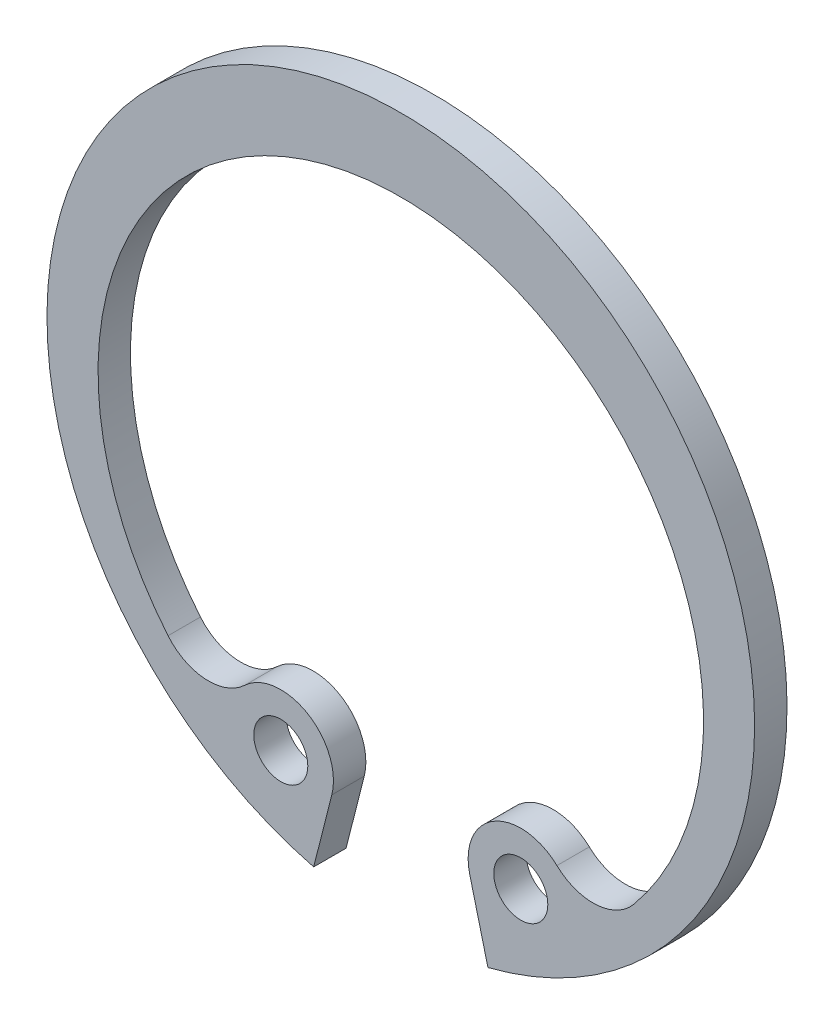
ISO-10303-21;
HEADER;
FILE_DESCRIPTION(('STEP AP214'),'2;1');
FILE_NAME('part.step','',(''),(''),'','','');
FILE_SCHEMA(('AUTOMOTIVE_DESIGN { 1 0 10303 214 1 1 1 1 }'));
ENDSEC;
DATA;
#1=APPLICATION_CONTEXT('core data for automotive mechanical design processes');
#2=APPLICATION_PROTOCOL_DEFINITION('international standard','automotive_design',2000,#1);
#3=PRODUCT_CONTEXT('',#1,'mechanical');
#4=PRODUCT('Part','Part','',(#3));
#5=PRODUCT_RELATED_PRODUCT_CATEGORY('part','',(#4));
#6=PRODUCT_DEFINITION_FORMATION('','',#4);
#7=PRODUCT_DEFINITION_CONTEXT('part definition',#1,'design');
#8=PRODUCT_DEFINITION('design','',#6,#7);
#9=PRODUCT_DEFINITION_SHAPE('','',#8);
#10=(LENGTH_UNIT() NAMED_UNIT(*) SI_UNIT(.MILLI.,.METRE.));
#11=(NAMED_UNIT(*) PLANE_ANGLE_UNIT() SI_UNIT($,.RADIAN.));
#12=(NAMED_UNIT(*) SI_UNIT($,.STERADIAN.) SOLID_ANGLE_UNIT());
#13=UNCERTAINTY_MEASURE_WITH_UNIT(LENGTH_MEASURE(1.E-05),#10,'distance_accuracy_value','');
#14=(GEOMETRIC_REPRESENTATION_CONTEXT(3) GLOBAL_UNCERTAINTY_ASSIGNED_CONTEXT((#13)) GLOBAL_UNIT_ASSIGNED_CONTEXT((#10,
#11,#12)) REPRESENTATION_CONTEXT('',''));
#15=CARTESIAN_POINT('',(0.,0.,0.));
#16=DIRECTION('',(0.,0.,1.));
#17=DIRECTION('',(1.,0.,0.));
#18=AXIS2_PLACEMENT_3D('',#15,#16,#17);
#19=CARTESIAN_POINT('',(0.,0.,-1.2));
#20=DIRECTION('',(0.,0.,1.));
#21=DIRECTION('',(1.,0.,0.));
#22=AXIS2_PLACEMENT_3D('',#19,#20,#21);
#23=CYLINDRICAL_SURFACE('',#22,13.1);
#24=CARTESIAN_POINT('',(0.,0.,0.));
#25=DIRECTION('',(0.,0.,1.));
#26=DIRECTION('',(1.,0.,0.));
#27=AXIS2_PLACEMENT_3D('',#24,#25,#26);
#28=CIRCLE('',#27,13.1);
#29=CARTESIAN_POINT('',(3.22587684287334,-12.6966026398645,0.));
#30=VERTEX_POINT('',#29);
#31=CARTESIAN_POINT('',(-3.22587684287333,-12.6966026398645,0.));
#32=VERTEX_POINT('',#31);
#33=EDGE_CURVE('E136',#30,#32,#28,.T.);
#34=ORIENTED_EDGE('',*,*,#33,.F.);
#35=DIRECTION('',(0.,0.,1.));
#36=VECTOR('',#35,1.);
#37=CARTESIAN_POINT('',(3.22587684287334,-12.6966026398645,-1.2));
#38=LINE('',#37,#36);
#39=CARTESIAN_POINT('',(3.22587684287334,-12.6966026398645,-1.2));
#40=VERTEX_POINT('',#39);
#41=EDGE_CURVE('E11',#40,#30,#38,.T.);
#42=ORIENTED_EDGE('',*,*,#41,.F.);
#43=CARTESIAN_POINT('',(0.,0.,-1.2));
#44=DIRECTION('',(0.,0.,1.));
#45=DIRECTION('',(1.,0.,0.));
#46=AXIS2_PLACEMENT_3D('',#43,#44,#45);
#47=CIRCLE('',#46,13.1);
#48=CARTESIAN_POINT('',(-3.22587684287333,-12.6966026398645,-1.2));
#49=VERTEX_POINT('',#48);
#50=EDGE_CURVE('E157',#40,#49,#47,.T.);
#51=ORIENTED_EDGE('',*,*,#50,.T.);
#52=DIRECTION('',(0.,0.,1.));
#53=VECTOR('',#52,1.);
#54=CARTESIAN_POINT('',(-3.22587684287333,-12.6966026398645,-1.2));
#55=LINE('',#54,#53);
#56=EDGE_CURVE('E42',#49,#32,#55,.T.);
#57=ORIENTED_EDGE('',*,*,#56,.T.);
#58=EDGE_LOOP('',(#34,#42,#51,#57));
#59=FACE_BOUND('',#58,.T.);
#60=ADVANCED_FACE('F39',(#59),#23,.T.);
#61=CARTESIAN_POINT('',(3.22587684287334,-12.6966026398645,-1.2));
#62=DIRECTION('',(-0.969206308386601,-0.246250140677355,0.));
#63=DIRECTION('',(0.246250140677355,-0.969206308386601,0.));
#64=AXIS2_PLACEMENT_3D('',#61,#62,#63);
#65=PLANE('',#64);
#66=DIRECTION('',(0.246250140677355,-0.969206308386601,0.));
#67=VECTOR('',#66,1.);
#68=CARTESIAN_POINT('',(3.22587684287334,-12.6966026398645,0.));
#69=LINE('',#68,#67);
#70=CARTESIAN_POINT('',(2.55317580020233,-10.048944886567,0.));
#71=VERTEX_POINT('',#70);
#72=EDGE_CURVE('E155',#71,#30,#69,.T.);
#73=ORIENTED_EDGE('',*,*,#72,.F.);
#74=DIRECTION('',(0.,0.,1.));
#75=VECTOR('',#74,1.);
#76=CARTESIAN_POINT('',(2.55317580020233,-10.048944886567,-1.2));
#77=LINE('',#76,#75);
#78=CARTESIAN_POINT('',(2.55317580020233,-10.048944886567,-1.2));
#79=VERTEX_POINT('',#78);
#80=EDGE_CURVE('E48',#79,#71,#77,.T.);
#81=ORIENTED_EDGE('',*,*,#80,.F.);
#82=DIRECTION('',(0.246250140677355,-0.969206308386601,0.));
#83=VECTOR('',#82,1.);
#84=CARTESIAN_POINT('',(3.22587684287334,-12.6966026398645,-1.2));
#85=LINE('',#84,#83);
#86=EDGE_CURVE('E126',#79,#40,#85,.T.);
#87=ORIENTED_EDGE('',*,*,#86,.T.);
#88=ORIENTED_EDGE('',*,*,#41,.T.);
#89=EDGE_LOOP('',(#73,#81,#87,#88));
#90=FACE_BOUND('',#89,.T.);
#91=ADVANCED_FACE('F169',(#90),#65,.T.);
#92=CARTESIAN_POINT('',(4.4431281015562,-9.56875711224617,-1.2));
#93=DIRECTION('',(0.,0.,1.));
#94=DIRECTION('',(1.,0.,0.));
#95=AXIS2_PLACEMENT_3D('',#92,#93,#94);
#96=CYLINDRICAL_SURFACE('',#95,1.95);
#97=CARTESIAN_POINT('',(4.4431281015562,-9.56875711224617,0.));
#98=DIRECTION('',(0.,0.,1.));
#99=DIRECTION('',(1.,0.,0.));
#100=AXIS2_PLACEMENT_3D('',#97,#98,#99);
#101=CIRCLE('',#100,1.95);
#102=CARTESIAN_POINT('',(5.78073292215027,-8.14984437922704,0.));
#103=VERTEX_POINT('',#102);
#104=EDGE_CURVE('E113',#103,#71,#101,.T.);
#105=ORIENTED_EDGE('',*,*,#104,.F.);
#106=DIRECTION('',(0.,0.,1.));
#107=VECTOR('',#106,1.);
#108=CARTESIAN_POINT('',(5.78073292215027,-8.14984437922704,-1.2));
#109=LINE('',#108,#107);
#110=CARTESIAN_POINT('',(5.78073292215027,-8.14984437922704,-1.2));
#111=VERTEX_POINT('',#110);
#112=EDGE_CURVE('E108',#111,#103,#109,.T.);
#113=ORIENTED_EDGE('',*,*,#112,.F.);
#114=CARTESIAN_POINT('',(4.4431281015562,-9.56875711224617,-1.2));
#115=DIRECTION('',(0.,0.,1.));
#116=DIRECTION('',(1.,0.,0.));
#117=AXIS2_PLACEMENT_3D('',#114,#115,#116);
#118=CIRCLE('',#117,1.95);
#119=EDGE_CURVE('E111',#111,#79,#118,.T.);
#120=ORIENTED_EDGE('',*,*,#119,.T.);
#121=ORIENTED_EDGE('',*,*,#80,.T.);
#122=EDGE_LOOP('',(#105,#113,#120,#121));
#123=FACE_BOUND('',#122,.T.);
#124=ADVANCED_FACE('F110',(#123),#96,.T.);
#125=CARTESIAN_POINT('',(7.11833774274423,-6.73093164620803,-1.2));
#126=DIRECTION('',(0.,0.,1.));
#127=DIRECTION('',(1.,0.,0.));
#128=AXIS2_PLACEMENT_3D('',#125,#126,#127);
#129=CYLINDRICAL_SURFACE('',#128,1.94999999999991);
#130=CARTESIAN_POINT('',(7.11833774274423,-6.73093164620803,0.));
#131=DIRECTION('',(0.,0.,-1.));
#132=DIRECTION('',(1.,0.,0.));
#133=AXIS2_PLACEMENT_3D('',#130,#131,#132);
#134=CIRCLE('',#133,1.94999999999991);
#135=CARTESIAN_POINT('',(8.61744338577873,-7.97800111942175,0.));
#136=VERTEX_POINT('',#135);
#137=EDGE_CURVE('E152',#136,#103,#134,.T.);
#138=ORIENTED_EDGE('',*,*,#137,.F.);
#139=DIRECTION('',(0.,0.,1.));
#140=VECTOR('',#139,1.);
#141=CARTESIAN_POINT('',(8.61744338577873,-7.97800111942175,-1.2));
#142=LINE('',#141,#140);
#143=CARTESIAN_POINT('',(8.61744338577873,-7.97800111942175,-1.2));
#144=VERTEX_POINT('',#143);
#145=EDGE_CURVE('E118',#144,#136,#142,.T.);
#146=ORIENTED_EDGE('',*,*,#145,.F.);
#147=CARTESIAN_POINT('',(7.11833774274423,-6.73093164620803,-1.2));
#148=DIRECTION('',(0.,0.,-1.));
#149=DIRECTION('',(1.,0.,0.));
#150=AXIS2_PLACEMENT_3D('',#147,#148,#149);
#151=CIRCLE('',#150,1.94999999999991);
#152=EDGE_CURVE('E124',#144,#111,#151,.T.);
#153=ORIENTED_EDGE('',*,*,#152,.T.);
#154=ORIENTED_EDGE('',*,*,#112,.T.);
#155=EDGE_LOOP('',(#138,#146,#153,#154));
#156=FACE_BOUND('',#155,.T.);
#157=ADVANCED_FACE('F128',(#156),#129,.F.);
#158=CARTESIAN_POINT('',(0.,-0.809359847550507,-1.2));
#159=DIRECTION('',(0.,0.,1.));
#160=DIRECTION('',(1.,0.,0.));
#161=AXIS2_PLACEMENT_3D('',#158,#159,#160);
#162=CYLINDRICAL_SURFACE('',#161,11.2093598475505);
#163=CARTESIAN_POINT('',(0.,-0.809359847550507,0.));
#164=DIRECTION('',(0.,0.,-1.));
#165=DIRECTION('',(1.,0.,0.));
#166=AXIS2_PLACEMENT_3D('',#163,#164,#165);
#167=CIRCLE('',#166,11.2093598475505);
#168=CARTESIAN_POINT('',(-8.61744338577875,-7.97800111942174,0.));
#169=VERTEX_POINT('',#168);
#170=EDGE_CURVE('E149',#169,#136,#167,.T.);
#171=ORIENTED_EDGE('',*,*,#170,.F.);
#172=DIRECTION('',(0.,0.,1.));
#173=VECTOR('',#172,1.);
#174=CARTESIAN_POINT('',(-8.61744338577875,-7.97800111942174,-1.2));
#175=LINE('',#174,#173);
#176=CARTESIAN_POINT('',(-8.61744338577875,-7.97800111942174,-1.2));
#177=VERTEX_POINT('',#176);
#178=EDGE_CURVE('E161',#177,#169,#175,.T.);
#179=ORIENTED_EDGE('',*,*,#178,.F.);
#180=CARTESIAN_POINT('',(0.,-0.809359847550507,-1.2));
#181=DIRECTION('',(0.,0.,-1.));
#182=DIRECTION('',(1.,0.,0.));
#183=AXIS2_PLACEMENT_3D('',#180,#181,#182);
#184=CIRCLE('',#183,11.2093598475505);
#185=EDGE_CURVE('E129',#177,#144,#184,.T.);
#186=ORIENTED_EDGE('',*,*,#185,.T.);
#187=ORIENTED_EDGE('',*,*,#145,.T.);
#188=EDGE_LOOP('',(#171,#179,#186,#187));
#189=FACE_BOUND('',#188,.T.);
#190=ADVANCED_FACE('F182',(#189),#162,.F.);
#191=CARTESIAN_POINT('',(-7.11833774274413,-6.73093164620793,-1.2));
#192=DIRECTION('',(0.,0.,1.));
#193=DIRECTION('',(1.,0.,0.));
#194=AXIS2_PLACEMENT_3D('',#191,#192,#193);
#195=CYLINDRICAL_SURFACE('',#194,1.95);
#196=CARTESIAN_POINT('',(-7.11833774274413,-6.73093164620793,0.));
#197=DIRECTION('',(0.,0.,-1.));
#198=DIRECTION('',(1.,0.,0.));
#199=AXIS2_PLACEMENT_3D('',#196,#197,#198);
#200=CIRCLE('',#199,1.95);
#201=CARTESIAN_POINT('',(-5.78073292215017,-8.14984437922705,0.));
#202=VERTEX_POINT('',#201);
#203=EDGE_CURVE('E146',#202,#169,#200,.T.);
#204=ORIENTED_EDGE('',*,*,#203,.F.);
#205=DIRECTION('',(0.,0.,1.));
#206=VECTOR('',#205,1.);
#207=CARTESIAN_POINT('',(-5.78073292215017,-8.14984437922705,-1.2));
#208=LINE('',#207,#206);
#209=CARTESIAN_POINT('',(-5.78073292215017,-8.14984437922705,-1.2));
#210=VERTEX_POINT('',#209);
#211=EDGE_CURVE('E163',#210,#202,#208,.T.);
#212=ORIENTED_EDGE('',*,*,#211,.F.);
#213=CARTESIAN_POINT('',(-7.11833774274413,-6.73093164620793,-1.2));
#214=DIRECTION('',(0.,0.,-1.));
#215=DIRECTION('',(1.,0.,0.));
#216=AXIS2_PLACEMENT_3D('',#213,#214,#215);
#217=CIRCLE('',#216,1.95);
#218=EDGE_CURVE('E131',#210,#177,#217,.T.);
#219=ORIENTED_EDGE('',*,*,#218,.T.);
#220=ORIENTED_EDGE('',*,*,#178,.T.);
#221=EDGE_LOOP('',(#204,#212,#219,#220));
#222=FACE_BOUND('',#221,.T.);
#223=ADVANCED_FACE('F185',(#222),#195,.F.);
#224=CARTESIAN_POINT('',(-4.4431281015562,-9.56875711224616,-1.2));
#225=DIRECTION('',(0.,0.,1.));
#226=DIRECTION('',(1.,0.,0.));
#227=AXIS2_PLACEMENT_3D('',#224,#225,#226);
#228=CYLINDRICAL_SURFACE('',#227,1.95);
#229=CARTESIAN_POINT('',(-4.4431281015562,-9.56875711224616,0.));
#230=DIRECTION('',(0.,0.,1.));
#231=DIRECTION('',(1.,0.,0.));
#232=AXIS2_PLACEMENT_3D('',#229,#230,#231);
#233=CIRCLE('',#232,1.95);
#234=CARTESIAN_POINT('',(-2.55317580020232,-10.048944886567,0.));
#235=VERTEX_POINT('',#234);
#236=EDGE_CURVE('E143',#235,#202,#233,.T.);
#237=ORIENTED_EDGE('',*,*,#236,.F.);
#238=DIRECTION('',(0.,0.,1.));
#239=VECTOR('',#238,1.);
#240=CARTESIAN_POINT('',(-2.55317580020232,-10.048944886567,-1.2));
#241=LINE('',#240,#239);
#242=CARTESIAN_POINT('',(-2.55317580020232,-10.048944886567,-1.2));
#243=VERTEX_POINT('',#242);
#244=EDGE_CURVE('E164',#243,#235,#241,.T.);
#245=ORIENTED_EDGE('',*,*,#244,.F.);
#246=CARTESIAN_POINT('',(-4.4431281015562,-9.56875711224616,-1.2));
#247=DIRECTION('',(0.,0.,1.));
#248=DIRECTION('',(1.,0.,0.));
#249=AXIS2_PLACEMENT_3D('',#246,#247,#248);
#250=CIRCLE('',#249,1.95);
#251=EDGE_CURVE('E231',#243,#210,#250,.T.);
#252=ORIENTED_EDGE('',*,*,#251,.T.);
#253=ORIENTED_EDGE('',*,*,#211,.T.);
#254=EDGE_LOOP('',(#237,#245,#252,#253));
#255=FACE_BOUND('',#254,.T.);
#256=ADVANCED_FACE('F189',(#255),#228,.T.);
#257=CARTESIAN_POINT('',(-3.22587684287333,-12.6966026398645,-1.2));
#258=DIRECTION('',(0.969206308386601,-0.246250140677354,0.));
#259=DIRECTION('',(0.246250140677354,0.969206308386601,0.));
#260=AXIS2_PLACEMENT_3D('',#257,#258,#259);
#261=PLANE('',#260);
#262=DIRECTION('',(0.246250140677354,0.969206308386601,0.));
#263=VECTOR('',#262,1.);
#264=CARTESIAN_POINT('',(-3.22587684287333,-12.6966026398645,0.));
#265=LINE('',#264,#263);
#266=EDGE_CURVE('E139',#32,#235,#265,.T.);
#267=ORIENTED_EDGE('',*,*,#266,.F.);
#268=ORIENTED_EDGE('',*,*,#56,.F.);
#269=DIRECTION('',(0.246250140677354,0.969206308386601,0.));
#270=VECTOR('',#269,1.);
#271=CARTESIAN_POINT('',(-3.22587684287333,-12.6966026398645,-1.2));
#272=LINE('',#271,#270);
#273=EDGE_CURVE('E229',#49,#243,#272,.T.);
#274=ORIENTED_EDGE('',*,*,#273,.T.);
#275=ORIENTED_EDGE('',*,*,#244,.T.);
#276=EDGE_LOOP('',(#267,#268,#274,#275));
#277=FACE_BOUND('',#276,.T.);
#278=ADVANCED_FACE('F166',(#277),#261,.T.);
#279=CARTESIAN_POINT('',(0.,0.,-1.2));
#280=DIRECTION('',(0.,0.,1.));
#281=DIRECTION('',(1.,0.,0.));
#282=AXIS2_PLACEMENT_3D('',#279,#280,#281);
#283=PLANE('',#282);
#284=CARTESIAN_POINT('',(-4.4431281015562,-9.56875711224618,-1.2));
#285=DIRECTION('',(0.,0.,1.));
#286=DIRECTION('',(1.,0.,0.));
#287=AXIS2_PLACEMENT_3D('',#284,#285,#286);
#288=CIRCLE('',#287,1.);
#289=CARTESIAN_POINT('',(-3.4431281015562,-9.56875711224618,-1.2));
#290=VERTEX_POINT('',#289);
#291=EDGE_CURVE('E216',#290,#290,#288,.T.);
#292=ORIENTED_EDGE('',*,*,#291,.T.);
#293=EDGE_LOOP('',(#292));
#294=FACE_BOUND('',#293,.T.);
#295=CARTESIAN_POINT('',(4.4431281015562,-9.56875711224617,-1.2));
#296=DIRECTION('',(0.,0.,1.));
#297=DIRECTION('',(1.,0.,0.));
#298=AXIS2_PLACEMENT_3D('',#295,#296,#297);
#299=CIRCLE('',#298,1.);
#300=CARTESIAN_POINT('',(5.4431281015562,-9.56875711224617,-1.2));
#301=VERTEX_POINT('',#300);
#302=EDGE_CURVE('E140',#301,#301,#299,.T.);
#303=ORIENTED_EDGE('',*,*,#302,.T.);
#304=EDGE_LOOP('',(#303));
#305=FACE_BOUND('',#304,.T.);
#306=ORIENTED_EDGE('',*,*,#50,.F.);
#307=ORIENTED_EDGE('',*,*,#86,.F.);
#308=ORIENTED_EDGE('',*,*,#119,.F.);
#309=ORIENTED_EDGE('',*,*,#152,.F.);
#310=ORIENTED_EDGE('',*,*,#185,.F.);
#311=ORIENTED_EDGE('',*,*,#218,.F.);
#312=ORIENTED_EDGE('',*,*,#251,.F.);
#313=ORIENTED_EDGE('',*,*,#273,.F.);
#314=EDGE_LOOP('',(#306,#307,#308,#309,#310,#311,#312,#313));
#315=FACE_BOUND('',#314,.T.);
#316=ADVANCED_FACE('F122',(#294,#305,#315),#283,.F.);
#317=CARTESIAN_POINT('',(0.,0.,0.));
#318=DIRECTION('',(0.,0.,1.));
#319=DIRECTION('',(1.,0.,0.));
#320=AXIS2_PLACEMENT_3D('',#317,#318,#319);
#321=PLANE('',#320);
#322=CARTESIAN_POINT('',(-4.4431281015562,-9.56875711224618,0.));
#323=DIRECTION('',(0.,0.,1.));
#324=DIRECTION('',(1.,0.,0.));
#325=AXIS2_PLACEMENT_3D('',#322,#323,#324);
#326=CIRCLE('',#325,1.);
#327=CARTESIAN_POINT('',(-3.4431281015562,-9.56875711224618,0.));
#328=VERTEX_POINT('',#327);
#329=EDGE_CURVE('E219',#328,#328,#326,.T.);
#330=ORIENTED_EDGE('',*,*,#329,.F.);
#331=EDGE_LOOP('',(#330));
#332=FACE_BOUND('',#331,.T.);
#333=CARTESIAN_POINT('',(4.4431281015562,-9.56875711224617,0.));
#334=DIRECTION('',(0.,0.,1.));
#335=DIRECTION('',(1.,0.,0.));
#336=AXIS2_PLACEMENT_3D('',#333,#334,#335);
#337=CIRCLE('',#336,1.);
#338=CARTESIAN_POINT('',(5.4431281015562,-9.56875711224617,0.));
#339=VERTEX_POINT('',#338);
#340=EDGE_CURVE('E221',#339,#339,#337,.T.);
#341=ORIENTED_EDGE('',*,*,#340,.F.);
#342=EDGE_LOOP('',(#341));
#343=FACE_BOUND('',#342,.T.);
#344=ORIENTED_EDGE('',*,*,#33,.T.);
#345=ORIENTED_EDGE('',*,*,#266,.T.);
#346=ORIENTED_EDGE('',*,*,#236,.T.);
#347=ORIENTED_EDGE('',*,*,#203,.T.);
#348=ORIENTED_EDGE('',*,*,#170,.T.);
#349=ORIENTED_EDGE('',*,*,#137,.T.);
#350=ORIENTED_EDGE('',*,*,#104,.T.);
#351=ORIENTED_EDGE('',*,*,#72,.T.);
#352=EDGE_LOOP('',(#344,#345,#346,#347,#348,#349,#350,#351));
#353=FACE_BOUND('',#352,.T.);
#354=ADVANCED_FACE('F168',(#332,#343,#353),#321,.T.);
#355=CARTESIAN_POINT('',(4.4431281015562,-9.56875711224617,-1.2));
#356=DIRECTION('',(0.,0.,1.));
#357=DIRECTION('',(1.,0.,0.));
#358=AXIS2_PLACEMENT_3D('',#355,#356,#357);
#359=CYLINDRICAL_SURFACE('',#358,1.);
#360=ORIENTED_EDGE('',*,*,#302,.F.);
#361=EDGE_LOOP('',(#360));
#362=FACE_BOUND('',#361,.T.);
#363=ORIENTED_EDGE('',*,*,#340,.T.);
#364=EDGE_LOOP('',(#363));
#365=FACE_BOUND('',#364,.T.);
#366=ADVANCED_FACE('F201',(#362,#365),#359,.F.);
#367=CARTESIAN_POINT('',(-4.4431281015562,-9.56875711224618,-1.2));
#368=DIRECTION('',(0.,0.,1.));
#369=DIRECTION('',(1.,0.,0.));
#370=AXIS2_PLACEMENT_3D('',#367,#368,#369);
#371=CYLINDRICAL_SURFACE('',#370,1.);
#372=ORIENTED_EDGE('',*,*,#291,.F.);
#373=EDGE_LOOP('',(#372));
#374=FACE_BOUND('',#373,.T.);
#375=ORIENTED_EDGE('',*,*,#329,.T.);
#376=EDGE_LOOP('',(#375));
#377=FACE_BOUND('',#376,.T.);
#378=ADVANCED_FACE('F208',(#374,#377),#371,.F.);
#379=CLOSED_SHELL('',(#60,#91,#124,#157,#190,#223,#256,#278,#316,#354,#366,#378));
#380=MANIFOLD_SOLID_BREP('B2',#379);
#381=ADVANCED_BREP_SHAPE_REPRESENTATION('',(#18,#380),#14);
#382=SHAPE_DEFINITION_REPRESENTATION(#9,#381);
ENDSEC;
END-ISO-10303-21;
